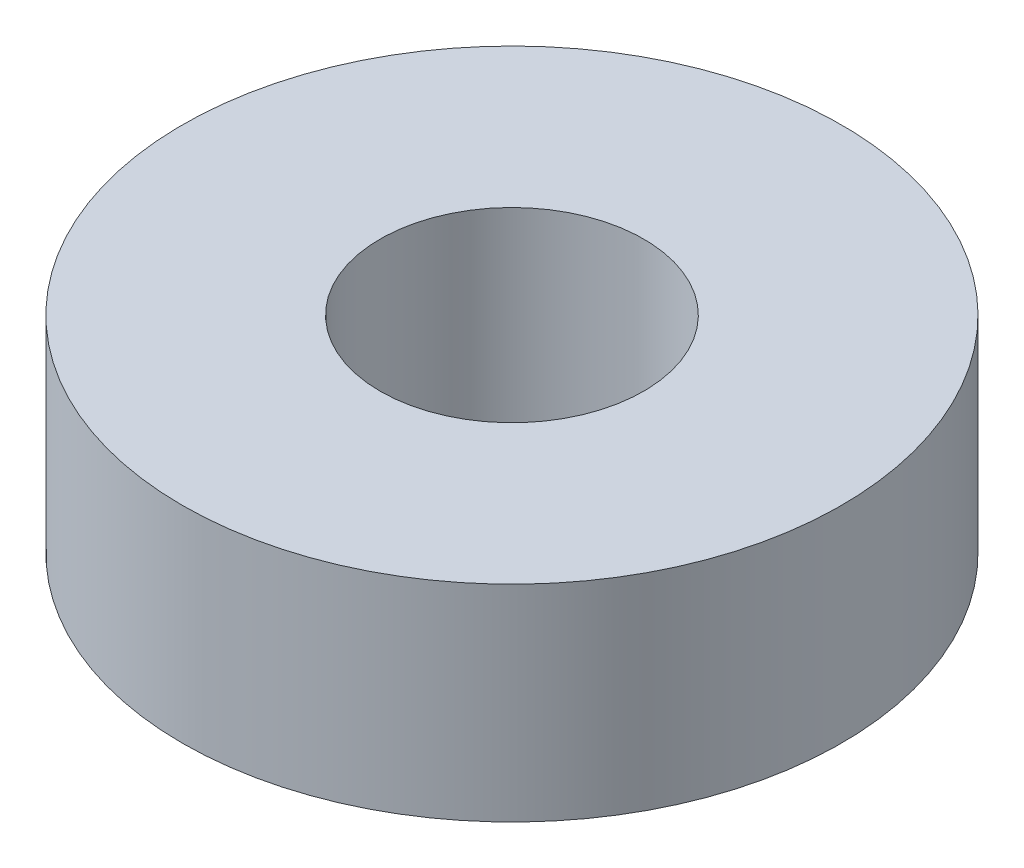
ISO-10303-21;
HEADER;
FILE_DESCRIPTION(('STEP AP214'),'2;1');
FILE_NAME('part.step','',(''),(''),'','','');
FILE_SCHEMA(('AUTOMOTIVE_DESIGN { 1 0 10303 214 1 1 1 1 }'));
ENDSEC;
DATA;
#1=APPLICATION_CONTEXT('core data for automotive mechanical design processes');
#2=APPLICATION_PROTOCOL_DEFINITION('international standard','automotive_design',2000,#1);
#3=PRODUCT_CONTEXT('',#1,'mechanical');
#4=PRODUCT('Part','Part','',(#3));
#5=PRODUCT_RELATED_PRODUCT_CATEGORY('part','',(#4));
#6=PRODUCT_DEFINITION_FORMATION('','',#4);
#7=PRODUCT_DEFINITION_CONTEXT('part definition',#1,'design');
#8=PRODUCT_DEFINITION('design','',#6,#7);
#9=PRODUCT_DEFINITION_SHAPE('','',#8);
#10=(LENGTH_UNIT() NAMED_UNIT(*) SI_UNIT(.MILLI.,.METRE.));
#11=(NAMED_UNIT(*) PLANE_ANGLE_UNIT() SI_UNIT($,.RADIAN.));
#12=(NAMED_UNIT(*) SI_UNIT($,.STERADIAN.) SOLID_ANGLE_UNIT());
#13=UNCERTAINTY_MEASURE_WITH_UNIT(LENGTH_MEASURE(1.E-05),#10,'distance_accuracy_value','');
#14=(GEOMETRIC_REPRESENTATION_CONTEXT(3) GLOBAL_UNCERTAINTY_ASSIGNED_CONTEXT((#13)) GLOBAL_UNIT_ASSIGNED_CONTEXT((#10,
#11,#12)) REPRESENTATION_CONTEXT('',''));
#15=CARTESIAN_POINT('',(0.,0.,0.));
#16=DIRECTION('',(0.,0.,1.));
#17=DIRECTION('',(1.,0.,0.));
#18=AXIS2_PLACEMENT_3D('',#15,#16,#17);
#19=CARTESIAN_POINT('',(0.,3.96875,0.));
#20=DIRECTION('',(0.,1.,0.));
#21=DIRECTION('',(0.,0.,1.));
#22=AXIS2_PLACEMENT_3D('',#19,#20,#21);
#23=PLANE('',#22);
#24=CARTESIAN_POINT('',(0.,3.96875,0.));
#25=DIRECTION('',(0.,1.,0.));
#26=DIRECTION('',(0.,0.,1.));
#27=AXIS2_PLACEMENT_3D('',#24,#25,#26);
#28=CIRCLE('',#27,6.35);
#29=CARTESIAN_POINT('',(0.,3.96875,6.35));
#30=VERTEX_POINT('',#29);
#31=EDGE_CURVE('E10',#30,#30,#28,.T.);
#32=ORIENTED_EDGE('',*,*,#31,.T.);
#33=EDGE_LOOP('',(#32));
#34=FACE_BOUND('',#33,.T.);
#35=CARTESIAN_POINT('',(0.,3.96875,0.));
#36=DIRECTION('',(0.,1.,0.));
#37=DIRECTION('',(0.,0.,1.));
#38=AXIS2_PLACEMENT_3D('',#35,#36,#37);
#39=CIRCLE('',#38,2.54);
#40=CARTESIAN_POINT('',(0.,3.96875,2.54));
#41=VERTEX_POINT('',#40);
#42=EDGE_CURVE('E41',#41,#41,#39,.T.);
#43=ORIENTED_EDGE('',*,*,#42,.F.);
#44=EDGE_LOOP('',(#43));
#45=FACE_BOUND('',#44,.T.);
#46=ADVANCED_FACE('F30',(#34,#45),#23,.T.);
#47=CARTESIAN_POINT('',(0.,0.,0.));
#48=DIRECTION('',(0.,1.,0.));
#49=DIRECTION('',(0.,0.,1.));
#50=AXIS2_PLACEMENT_3D('',#47,#48,#49);
#51=PLANE('',#50);
#52=CARTESIAN_POINT('',(0.,0.,0.));
#53=DIRECTION('',(0.,1.,0.));
#54=DIRECTION('',(0.,0.,1.));
#55=AXIS2_PLACEMENT_3D('',#52,#53,#54);
#56=CIRCLE('',#55,6.35);
#57=CARTESIAN_POINT('',(0.,0.,6.35));
#58=VERTEX_POINT('',#57);
#59=EDGE_CURVE('E34',#58,#58,#56,.T.);
#60=ORIENTED_EDGE('',*,*,#59,.F.);
#61=EDGE_LOOP('',(#60));
#62=FACE_BOUND('',#61,.T.);
#63=CARTESIAN_POINT('',(0.,0.,0.));
#64=DIRECTION('',(0.,1.,0.));
#65=DIRECTION('',(0.,0.,1.));
#66=AXIS2_PLACEMENT_3D('',#63,#64,#65);
#67=CIRCLE('',#66,2.54);
#68=CARTESIAN_POINT('',(0.,0.,2.54));
#69=VERTEX_POINT('',#68);
#70=EDGE_CURVE('E43',#69,#69,#67,.T.);
#71=ORIENTED_EDGE('',*,*,#70,.T.);
#72=EDGE_LOOP('',(#71));
#73=FACE_BOUND('',#72,.T.);
#74=ADVANCED_FACE('F53',(#62,#73),#51,.F.);
#75=CARTESIAN_POINT('',(0.,3.96875,0.));
#76=DIRECTION('',(0.,-1.,0.));
#77=DIRECTION('',(0.,0.,-1.));
#78=AXIS2_PLACEMENT_3D('',#75,#76,#77);
#79=CYLINDRICAL_SURFACE('',#78,6.35);
#80=ORIENTED_EDGE('',*,*,#31,.F.);
#81=EDGE_LOOP('',(#80));
#82=FACE_BOUND('',#81,.T.);
#83=ORIENTED_EDGE('',*,*,#59,.T.);
#84=EDGE_LOOP('',(#83));
#85=FACE_BOUND('',#84,.T.);
#86=ADVANCED_FACE('F32',(#82,#85),#79,.T.);
#87=CARTESIAN_POINT('',(0.,3.96875,0.));
#88=DIRECTION('',(0.,-1.,0.));
#89=DIRECTION('',(0.,0.,-1.));
#90=AXIS2_PLACEMENT_3D('',#87,#88,#89);
#91=CYLINDRICAL_SURFACE('',#90,2.54);
#92=ORIENTED_EDGE('',*,*,#42,.T.);
#93=EDGE_LOOP('',(#92));
#94=FACE_BOUND('',#93,.T.);
#95=ORIENTED_EDGE('',*,*,#70,.F.);
#96=EDGE_LOOP('',(#95));
#97=FACE_BOUND('',#96,.T.);
#98=ADVANCED_FACE('F49',(#94,#97),#91,.F.);
#99=CLOSED_SHELL('',(#46,#74,#86,#98));
#100=MANIFOLD_SOLID_BREP('B2',#99);
#101=ADVANCED_BREP_SHAPE_REPRESENTATION('',(#18,#100),#14);
#102=SHAPE_DEFINITION_REPRESENTATION(#9,#101);
ENDSEC;
END-ISO-10303-21;
